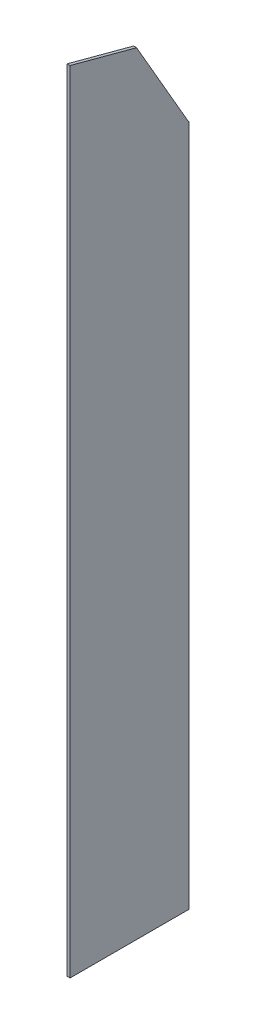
ISO-10303-21;
HEADER;
FILE_DESCRIPTION(('STEP AP214'),'2;1');
FILE_NAME('part.step','',(''),(''),'','','');
FILE_SCHEMA(('AUTOMOTIVE_DESIGN { 1 0 10303 214 1 1 1 1 }'));
ENDSEC;
DATA;
#1=APPLICATION_CONTEXT('core data for automotive mechanical design processes');
#2=APPLICATION_PROTOCOL_DEFINITION('international standard','automotive_design',2000,#1);
#3=PRODUCT_CONTEXT('',#1,'mechanical');
#4=PRODUCT('Part','Part','',(#3));
#5=PRODUCT_RELATED_PRODUCT_CATEGORY('part','',(#4));
#6=PRODUCT_DEFINITION_FORMATION('','',#4);
#7=PRODUCT_DEFINITION_CONTEXT('part definition',#1,'design');
#8=PRODUCT_DEFINITION('design','',#6,#7);
#9=PRODUCT_DEFINITION_SHAPE('','',#8);
#10=(LENGTH_UNIT() NAMED_UNIT(*) SI_UNIT(.MILLI.,.METRE.));
#11=(NAMED_UNIT(*) PLANE_ANGLE_UNIT() SI_UNIT($,.RADIAN.));
#12=(NAMED_UNIT(*) SI_UNIT($,.STERADIAN.) SOLID_ANGLE_UNIT());
#13=UNCERTAINTY_MEASURE_WITH_UNIT(LENGTH_MEASURE(1.E-05),#10,'distance_accuracy_value','');
#14=(GEOMETRIC_REPRESENTATION_CONTEXT(3) GLOBAL_UNCERTAINTY_ASSIGNED_CONTEXT((#13)) GLOBAL_UNIT_ASSIGNED_CONTEXT((#10,
#11,#12)) REPRESENTATION_CONTEXT('',''));
#15=CARTESIAN_POINT('',(0.,0.,0.));
#16=DIRECTION('',(0.,0.,1.));
#17=DIRECTION('',(1.,0.,0.));
#18=AXIS2_PLACEMENT_3D('',#15,#16,#17);
#19=CARTESIAN_POINT('',(9.52500000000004,5101.6125,381.));
#20=DIRECTION('',(-1.,0.,0.));
#21=DIRECTION('',(0.,0.,1.));
#22=AXIS2_PLACEMENT_3D('',#19,#20,#21);
#23=PLANE('',#22);
#24=DIRECTION('',(0.,-0.258819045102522,-0.965925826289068));
#25=VECTOR('',#24,1.);
#26=CARTESIAN_POINT('',(9.52500000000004,4959.30710999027,-45.4859399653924));
#27=LINE('',#26,#25);
#28=CARTESIAN_POINT('',(9.52500000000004,5073.58367318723,381.));
#29=VERTEX_POINT('',#28);
#30=CARTESIAN_POINT('',(9.52499999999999,4959.30710999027,-45.4859399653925));
#31=VERTEX_POINT('',#30);
#32=EDGE_CURVE('E60',#29,#31,#27,.T.);
#33=ORIENTED_EDGE('',*,*,#32,.F.);
#34=DIRECTION('',(0.,-1.,0.));
#35=VECTOR('',#34,1.);
#36=CARTESIAN_POINT('',(9.52500000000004,5101.6125,381.));
#37=LINE('',#36,#35);
#38=CARTESIAN_POINT('',(9.52500000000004,5.99999999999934,381.));
#39=VERTEX_POINT('',#38);
#40=EDGE_CURVE('E157',#29,#39,#37,.T.);
#41=ORIENTED_EDGE('',*,*,#40,.T.);
#42=DIRECTION('',(0.,0.,-1.));
#43=VECTOR('',#42,1.);
#44=CARTESIAN_POINT('',(9.52500000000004,5.99999999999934,381.));
#45=LINE('',#44,#43);
#46=CARTESIAN_POINT('',(9.52499999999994,5.99999999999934,-381.));
#47=VERTEX_POINT('',#46);
#48=EDGE_CURVE('E185',#39,#47,#45,.T.);
#49=ORIENTED_EDGE('',*,*,#48,.T.);
#50=DIRECTION('',(0.,-1.,0.));
#51=VECTOR('',#50,1.);
#52=CARTESIAN_POINT('',(9.52499999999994,5101.6125,-381.));
#53=LINE('',#52,#51);
#54=CARTESIAN_POINT('',(9.52500000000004,4380.42971135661,-381.));
#55=VERTEX_POINT('',#54);
#56=EDGE_CURVE('E132',#55,#47,#53,.T.);
#57=ORIENTED_EDGE('',*,*,#56,.F.);
#58=DIRECTION('',(0.,0.,-1.));
#59=VECTOR('',#58,1.);
#60=CARTESIAN_POINT('',(9.52500000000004,4380.42971135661,-379.700961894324));
#61=LINE('',#60,#59);
#62=CARTESIAN_POINT('',(9.52500000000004,4380.42971135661,-379.700961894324));
#63=VERTEX_POINT('',#62);
#64=EDGE_CURVE('E119',#63,#55,#61,.T.);
#65=ORIENTED_EDGE('',*,*,#64,.F.);
#66=DIRECTION('',(0.,-0.86602540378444,-0.499999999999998));
#67=VECTOR('',#66,1.);
#68=CARTESIAN_POINT('',(9.52500000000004,4380.42971135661,-379.700961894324));
#69=LINE('',#68,#67);
#70=EDGE_CURVE('E130',#31,#63,#69,.T.);
#71=ORIENTED_EDGE('',*,*,#70,.F.);
#72=EDGE_LOOP('',(#33,#41,#49,#57,#65,#71));
#73=FACE_BOUND('',#72,.T.);
#74=ADVANCED_FACE('F50',(#73),#23,.F.);
#75=CARTESIAN_POINT('',(-9.52499999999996,5101.6125,381.));
#76=DIRECTION('',(1.,0.,0.));
#77=DIRECTION('',(0.,0.,-1.));
#78=AXIS2_PLACEMENT_3D('',#75,#76,#77);
#79=PLANE('',#78);
#80=DIRECTION('',(0.,-1.,0.));
#81=VECTOR('',#80,1.);
#82=CARTESIAN_POINT('',(-9.52499999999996,5101.6125,381.));
#83=LINE('',#82,#81);
#84=CARTESIAN_POINT('',(-9.52500000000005,5073.58367318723,381.));
#85=VERTEX_POINT('',#84);
#86=CARTESIAN_POINT('',(-9.52499999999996,5.99999999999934,381.));
#87=VERTEX_POINT('',#86);
#88=EDGE_CURVE('E165',#85,#87,#83,.T.);
#89=ORIENTED_EDGE('',*,*,#88,.F.);
#90=DIRECTION('',(0.,-0.258819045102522,-0.965925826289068));
#91=VECTOR('',#90,1.);
#92=CARTESIAN_POINT('',(-9.52500000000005,4959.30710999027,-45.4859399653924));
#93=LINE('',#92,#91);
#94=CARTESIAN_POINT('',(-9.52500000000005,4959.30710999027,-45.4859399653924));
#95=VERTEX_POINT('',#94);
#96=EDGE_CURVE('E139',#85,#95,#93,.T.);
#97=ORIENTED_EDGE('',*,*,#96,.T.);
#98=DIRECTION('',(0.,-0.86602540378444,-0.499999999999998));
#99=VECTOR('',#98,1.);
#100=CARTESIAN_POINT('',(-9.52500000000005,4380.42971135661,-379.700961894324));
#101=LINE('',#100,#99);
#102=CARTESIAN_POINT('',(-9.52500000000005,4380.42971135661,-379.700961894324));
#103=VERTEX_POINT('',#102);
#104=EDGE_CURVE('E143',#95,#103,#101,.T.);
#105=ORIENTED_EDGE('',*,*,#104,.T.);
#106=DIRECTION('',(0.,0.,-1.));
#107=VECTOR('',#106,1.);
#108=CARTESIAN_POINT('',(-9.52500000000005,4380.42971135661,-379.700961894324));
#109=LINE('',#108,#107);
#110=CARTESIAN_POINT('',(-9.52500000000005,4380.42971135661,-381.));
#111=VERTEX_POINT('',#110);
#112=EDGE_CURVE('E122',#103,#111,#109,.T.);
#113=ORIENTED_EDGE('',*,*,#112,.T.);
#114=DIRECTION('',(0.,-1.,0.));
#115=VECTOR('',#114,1.);
#116=CARTESIAN_POINT('',(-9.52500000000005,5101.6125,-381.));
#117=LINE('',#116,#115);
#118=CARTESIAN_POINT('',(-9.52500000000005,5.99999999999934,-381.));
#119=VERTEX_POINT('',#118);
#120=EDGE_CURVE('E75',#111,#119,#117,.T.);
#121=ORIENTED_EDGE('',*,*,#120,.T.);
#122=DIRECTION('',(0.,0.,1.));
#123=VECTOR('',#122,1.);
#124=CARTESIAN_POINT('',(-9.52499999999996,5.99999999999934,381.));
#125=LINE('',#124,#123);
#126=EDGE_CURVE('E186',#119,#87,#125,.T.);
#127=ORIENTED_EDGE('',*,*,#126,.T.);
#128=EDGE_LOOP('',(#89,#97,#105,#113,#121,#127));
#129=FACE_BOUND('',#128,.T.);
#130=ADVANCED_FACE('F230',(#129),#79,.F.);
#131=CARTESIAN_POINT('',(9.52500000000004,5101.6125,381.));
#132=DIRECTION('',(0.,0.,-1.));
#133=DIRECTION('',(-1.,0.,0.));
#134=AXIS2_PLACEMENT_3D('',#131,#132,#133);
#135=PLANE('',#134);
#136=ORIENTED_EDGE('',*,*,#40,.F.);
#137=DIRECTION('',(-1.,0.,0.));
#138=VECTOR('',#137,1.);
#139=CARTESIAN_POINT('',(9.52500000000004,5073.58367318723,381.));
#140=LINE('',#139,#138);
#141=EDGE_CURVE('E11',#29,#85,#140,.T.);
#142=ORIENTED_EDGE('',*,*,#141,.T.);
#143=ORIENTED_EDGE('',*,*,#88,.T.);
#144=DIRECTION('',(1.,0.,0.));
#145=VECTOR('',#144,1.);
#146=CARTESIAN_POINT('',(9.52500000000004,5.99999999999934,381.));
#147=LINE('',#146,#145);
#148=EDGE_CURVE('E164',#87,#39,#147,.T.);
#149=ORIENTED_EDGE('',*,*,#148,.T.);
#150=EDGE_LOOP('',(#136,#142,#143,#149));
#151=FACE_BOUND('',#150,.T.);
#152=ADVANCED_FACE('F223',(#151),#135,.F.);
#153=CARTESIAN_POINT('',(9.52499999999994,5101.6125,-381.));
#154=DIRECTION('',(0.,0.,1.));
#155=DIRECTION('',(1.,0.,0.));
#156=AXIS2_PLACEMENT_3D('',#153,#154,#155);
#157=PLANE('',#156);
#158=ORIENTED_EDGE('',*,*,#120,.F.);
#159=DIRECTION('',(1.,0.,0.));
#160=VECTOR('',#159,1.);
#161=CARTESIAN_POINT('',(-9.52500000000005,4380.42971135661,-381.));
#162=LINE('',#161,#160);
#163=EDGE_CURVE('E121',#111,#55,#162,.T.);
#164=ORIENTED_EDGE('',*,*,#163,.T.);
#165=ORIENTED_EDGE('',*,*,#56,.T.);
#166=DIRECTION('',(-1.,0.,0.));
#167=VECTOR('',#166,1.);
#168=CARTESIAN_POINT('',(9.52499999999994,5.99999999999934,-381.));
#169=LINE('',#168,#167);
#170=EDGE_CURVE('E183',#47,#119,#169,.T.);
#171=ORIENTED_EDGE('',*,*,#170,.T.);
#172=EDGE_LOOP('',(#158,#164,#165,#171));
#173=FACE_BOUND('',#172,.T.);
#174=ADVANCED_FACE('F231',(#173),#157,.F.);
#175=CARTESIAN_POINT('',(0.,0.,0.));
#176=DIRECTION('',(0.,1.,0.));
#177=DIRECTION('',(0.,0.,1.));
#178=AXIS2_PLACEMENT_3D('',#175,#176,#177);
#179=PLANE('',#178);
#180=DIRECTION('',(0.,0.,1.));
#181=VECTOR('',#180,1.);
#182=CARTESIAN_POINT('',(3.52500000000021,0.,0.));
#183=LINE('',#182,#181);
#184=CARTESIAN_POINT('',(3.52500000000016,0.,-375.));
#185=VERTEX_POINT('',#184);
#186=CARTESIAN_POINT('',(3.52500000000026,0.,375.));
#187=VERTEX_POINT('',#186);
#188=EDGE_CURVE('E172',#185,#187,#183,.T.);
#189=ORIENTED_EDGE('',*,*,#188,.T.);
#190=DIRECTION('',(-1.,0.,0.));
#191=VECTOR('',#190,1.);
#192=CARTESIAN_POINT('',(0.,0.,375.));
#193=LINE('',#192,#191);
#194=CARTESIAN_POINT('',(-3.52500000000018,0.,375.));
#195=VERTEX_POINT('',#194);
#196=EDGE_CURVE('E180',#187,#195,#193,.T.);
#197=ORIENTED_EDGE('',*,*,#196,.T.);
#198=DIRECTION('',(0.,0.,-1.));
#199=VECTOR('',#198,1.);
#200=CARTESIAN_POINT('',(-3.52500000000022,0.,0.));
#201=LINE('',#200,#199);
#202=CARTESIAN_POINT('',(-3.52500000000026,0.,-375.));
#203=VERTEX_POINT('',#202);
#204=EDGE_CURVE('E166',#195,#203,#201,.T.);
#205=ORIENTED_EDGE('',*,*,#204,.T.);
#206=DIRECTION('',(1.,0.,0.));
#207=VECTOR('',#206,1.);
#208=CARTESIAN_POINT('',(0.,0.,-375.));
#209=LINE('',#208,#207);
#210=EDGE_CURVE('E175',#203,#185,#209,.T.);
#211=ORIENTED_EDGE('',*,*,#210,.T.);
#212=EDGE_LOOP('',(#189,#197,#205,#211));
#213=FACE_BOUND('',#212,.T.);
#214=ADVANCED_FACE('F212',(#213),#179,.F.);
#215=CARTESIAN_POINT('',(9.52499999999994,5.99999999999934,-381.));
#216=DIRECTION('',(0.,0.707106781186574,0.707106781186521));
#217=DIRECTION('',(-1.,0.,0.));
#218=AXIS2_PLACEMENT_3D('',#215,#216,#217);
#219=PLANE('',#218);
#220=DIRECTION('',(-0.57735026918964,-0.577350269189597,0.57735026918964));
#221=VECTOR('',#220,1.);
#222=CARTESIAN_POINT('',(9.52499999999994,5.99999999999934,-381.));
#223=LINE('',#222,#221);
#224=EDGE_CURVE('E197',#185,#47,#223,.F.);
#225=ORIENTED_EDGE('',*,*,#224,.F.);
#226=ORIENTED_EDGE('',*,*,#210,.F.);
#227=DIRECTION('',(0.57735026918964,-0.577350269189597,0.57735026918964));
#228=VECTOR('',#227,1.);
#229=CARTESIAN_POINT('',(244.475000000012,-247.999999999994,-126.999999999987));
#230=LINE('',#229,#228);
#231=EDGE_CURVE('E156',#119,#203,#230,.T.);
#232=ORIENTED_EDGE('',*,*,#231,.F.);
#233=ORIENTED_EDGE('',*,*,#170,.F.);
#234=EDGE_LOOP('',(#225,#226,#232,#233));
#235=FACE_BOUND('',#234,.T.);
#236=ADVANCED_FACE('F49',(#235),#219,.F.);
#237=CARTESIAN_POINT('',(-9.52499999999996,5.99999999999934,381.));
#238=DIRECTION('',(0.707106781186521,0.707106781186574,0.));
#239=DIRECTION('',(0.,0.,1.));
#240=AXIS2_PLACEMENT_3D('',#237,#238,#239);
#241=PLANE('',#240);
#242=ORIENTED_EDGE('',*,*,#231,.T.);
#243=ORIENTED_EDGE('',*,*,#204,.F.);
#244=DIRECTION('',(-0.57735026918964,0.577350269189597,0.57735026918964));
#245=VECTOR('',#244,1.);
#246=CARTESIAN_POINT('',(-9.52499999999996,5.99999999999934,381.));
#247=LINE('',#246,#245);
#248=EDGE_CURVE('E191',#87,#195,#247,.F.);
#249=ORIENTED_EDGE('',*,*,#248,.F.);
#250=ORIENTED_EDGE('',*,*,#126,.F.);
#251=EDGE_LOOP('',(#242,#243,#249,#250));
#252=FACE_BOUND('',#251,.T.);
#253=ADVANCED_FACE('F206',(#252),#241,.F.);
#254=CARTESIAN_POINT('',(9.52500000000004,5.99999999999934,381.));
#255=DIRECTION('',(-0.707106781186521,0.707106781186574,0.));
#256=DIRECTION('',(0.,0.,-1.));
#257=AXIS2_PLACEMENT_3D('',#254,#255,#256);
#258=PLANE('',#257);
#259=ORIENTED_EDGE('',*,*,#224,.T.);
#260=ORIENTED_EDGE('',*,*,#48,.F.);
#261=DIRECTION('',(-0.57735026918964,-0.577350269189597,-0.57735026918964));
#262=VECTOR('',#261,1.);
#263=CARTESIAN_POINT('',(9.52500000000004,5.99999999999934,381.));
#264=LINE('',#263,#262);
#265=EDGE_CURVE('E147',#187,#39,#264,.F.);
#266=ORIENTED_EDGE('',*,*,#265,.F.);
#267=ORIENTED_EDGE('',*,*,#188,.F.);
#268=EDGE_LOOP('',(#259,#260,#266,#267));
#269=FACE_BOUND('',#268,.T.);
#270=ADVANCED_FACE('F225',(#269),#258,.F.);
#271=CARTESIAN_POINT('',(9.52500000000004,5.99999999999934,381.));
#272=DIRECTION('',(0.,0.707106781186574,-0.707106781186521));
#273=DIRECTION('',(1.,0.,0.));
#274=AXIS2_PLACEMENT_3D('',#271,#272,#273);
#275=PLANE('',#274);
#276=ORIENTED_EDGE('',*,*,#248,.T.);
#277=ORIENTED_EDGE('',*,*,#196,.F.);
#278=ORIENTED_EDGE('',*,*,#265,.T.);
#279=ORIENTED_EDGE('',*,*,#148,.F.);
#280=EDGE_LOOP('',(#276,#277,#278,#279));
#281=FACE_BOUND('',#280,.T.);
#282=ADVANCED_FACE('F217',(#281),#275,.F.);
#283=CARTESIAN_POINT('',(-9.52500000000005,4959.30710999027,-45.4859399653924));
#284=DIRECTION('',(0.,-0.965925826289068,0.258819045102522));
#285=DIRECTION('',(0.,-0.258819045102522,-0.965925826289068));
#286=AXIS2_PLACEMENT_3D('',#283,#284,#285);
#287=PLANE('',#286);
#288=ORIENTED_EDGE('',*,*,#32,.T.);
#289=DIRECTION('',(1.,0.,0.));
#290=VECTOR('',#289,1.);
#291=CARTESIAN_POINT('',(-9.52500000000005,4959.30710999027,-45.4859399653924));
#292=LINE('',#291,#290);
#293=EDGE_CURVE('E64',#95,#31,#292,.T.);
#294=ORIENTED_EDGE('',*,*,#293,.F.);
#295=ORIENTED_EDGE('',*,*,#96,.F.);
#296=ORIENTED_EDGE('',*,*,#141,.F.);
#297=EDGE_LOOP('',(#288,#294,#295,#296));
#298=FACE_BOUND('',#297,.T.);
#299=ADVANCED_FACE('F244',(#298),#287,.F.);
#300=CARTESIAN_POINT('',(-9.52500000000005,4380.42971135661,-379.700961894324));
#301=DIRECTION('',(0.,-1.,0.));
#302=DIRECTION('',(0.,0.,-1.));
#303=AXIS2_PLACEMENT_3D('',#300,#301,#302);
#304=PLANE('',#303);
#305=ORIENTED_EDGE('',*,*,#163,.F.);
#306=ORIENTED_EDGE('',*,*,#112,.F.);
#307=DIRECTION('',(1.,0.,0.));
#308=VECTOR('',#307,1.);
#309=CARTESIAN_POINT('',(-9.52500000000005,4380.42971135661,-379.700961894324));
#310=LINE('',#309,#308);
#311=EDGE_CURVE('E118',#103,#63,#310,.T.);
#312=ORIENTED_EDGE('',*,*,#311,.T.);
#313=ORIENTED_EDGE('',*,*,#64,.T.);
#314=EDGE_LOOP('',(#305,#306,#312,#313));
#315=FACE_BOUND('',#314,.T.);
#316=ADVANCED_FACE('F120',(#315),#304,.F.);
#317=CARTESIAN_POINT('',(-9.52500000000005,4380.42971135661,-379.700961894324));
#318=DIRECTION('',(0.,-0.499999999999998,0.86602540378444));
#319=DIRECTION('',(0.,-0.86602540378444,-0.499999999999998));
#320=AXIS2_PLACEMENT_3D('',#317,#318,#319);
#321=PLANE('',#320);
#322=ORIENTED_EDGE('',*,*,#311,.F.);
#323=ORIENTED_EDGE('',*,*,#104,.F.);
#324=ORIENTED_EDGE('',*,*,#293,.T.);
#325=ORIENTED_EDGE('',*,*,#70,.T.);
#326=EDGE_LOOP('',(#322,#323,#324,#325));
#327=FACE_BOUND('',#326,.T.);
#328=ADVANCED_FACE('F126',(#327),#321,.F.);
#329=CLOSED_SHELL('',(#74,#130,#152,#174,#214,#236,#253,#270,#282,#299,#316,#328));
#330=MANIFOLD_SOLID_BREP('B2',#329);
#331=ADVANCED_BREP_SHAPE_REPRESENTATION('',(#18,#330),#14);
#332=SHAPE_DEFINITION_REPRESENTATION(#9,#331);
ENDSEC;
END-ISO-10303-21;
